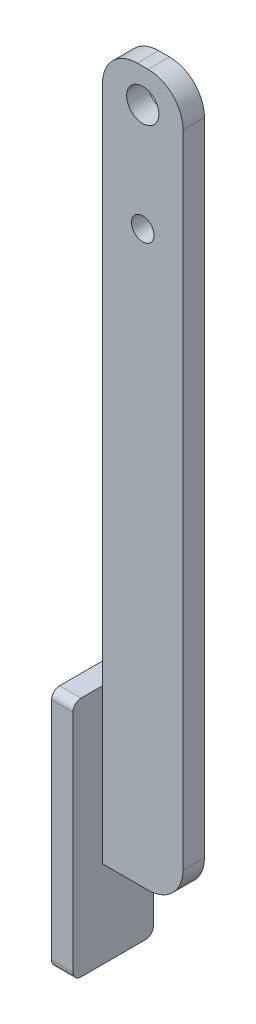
from build123d import *

# Parameters (mm, degrees)
SKETCH1_W           = 30
SKETCH1_H           = 265
SKETCH1_R           = 6
SKETCH1_R_2         = 4.2
BOSS_EXTRUDE1_DEPTH = 4
FILLET1_R           = 13
SKETCH2_W           = 30
SKETCH2_H           = 90
BOSS_EXTRUDE2_DEPTH = 8
SKETCH3_R           = 5.736099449
CUT_EXTRUDE1_DEPTH  = 1
FILLET2_R           = 3
FILLET3_R           = 13


with BuildPart() as part:
    # Sketch1 → Boss-Extrude1 (new, symmetric)
    with BuildSketch(Plane.XY):
        with Locations((0, -120)):
            Rectangle(SKETCH1_W, SKETCH1_H)
        Circle(SKETCH1_R, mode=Mode.SUBTRACT)
        with Locations((0, -40)):
            Circle(SKETCH1_R_2, mode=Mode.SUBTRACT)
    extrude(amount=BOSS_EXTRUDE1_DEPTH, both=True)

    # Fillet1
    fillet1_edges = [part.edges().sort_by_distance(p)[0] for p in [
        (-15, 12.5, 0),
        (15, 12.5, 0),
    ]]
    fillet(fillet1_edges, radius=FILLET1_R)

    # Sketch2 → Boss-Extrude2 (add)
    with BuildSketch(Plane.ZY.offset(15)):
        with Locations((0, -240)):
            Rectangle(SKETCH2_W, SKETCH2_H)
    extrude(amount=BOSS_EXTRUDE2_DEPTH)

    # Sketch3 → Cut-Extrude1 (cut)
    with BuildSketch(Plane.ZY.offset(23)):
        with Locations(Location((0, -240, 0), (0, 0, 270))):
            Circle(SKETCH3_R)
    extrude(amount=-CUT_EXTRUDE1_DEPTH, mode=Mode.SUBTRACT)

    # Fillet2
    fillet2_edges = [part.edges().sort_by_distance(p)[0] for p in [
        (-19, -195, 15),
        (-19, -195, -15),
        (-19, -285, -15),
        (-19, -285, 15),
    ]]
    fillet(fillet2_edges, radius=FILLET2_R)

    # Fillet3
    fillet3_edges = [part.edges().sort_by_distance(p)[0] for p in [
        (15, -252.5, 0),
    ]]
    fillet(fillet3_edges, radius=FILLET3_R)


solid = part.part
